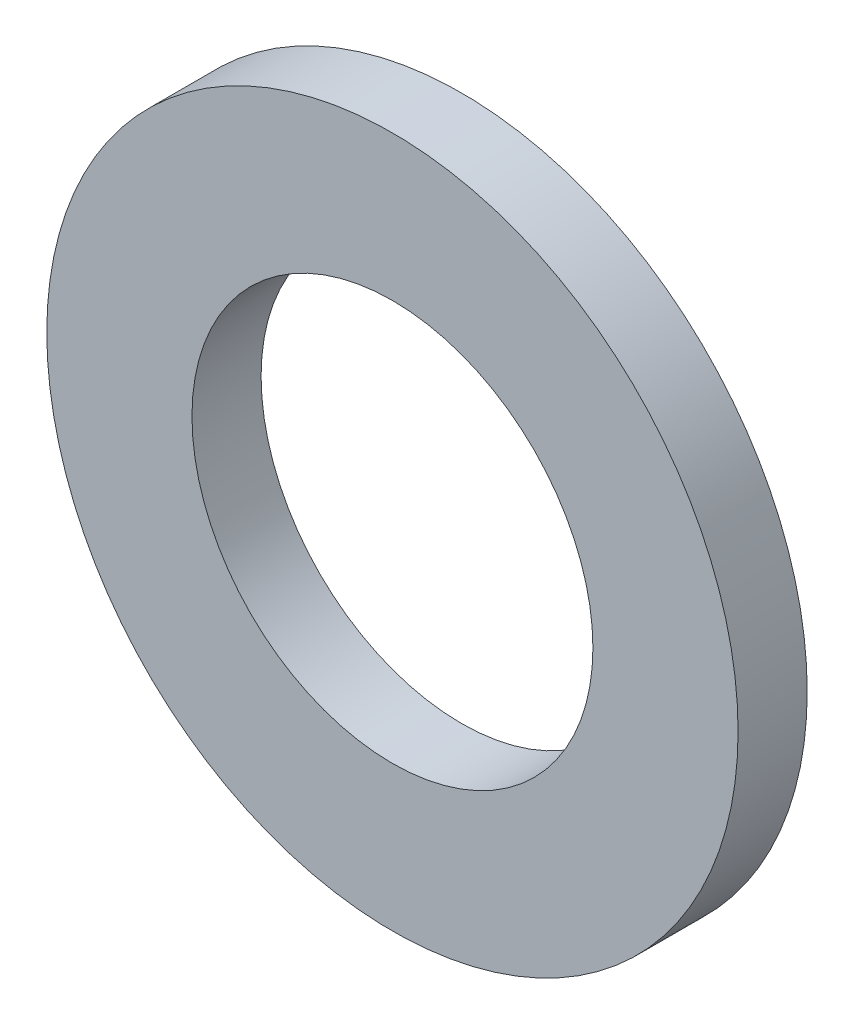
ISO-10303-21;
HEADER;
FILE_DESCRIPTION(('STEP AP214'),'2;1');
FILE_NAME('part.step','',(''),(''),'','','');
FILE_SCHEMA(('AUTOMOTIVE_DESIGN { 1 0 10303 214 1 1 1 1 }'));
ENDSEC;
DATA;
#1=APPLICATION_CONTEXT('core data for automotive mechanical design processes');
#2=APPLICATION_PROTOCOL_DEFINITION('international standard','automotive_design',2000,#1);
#3=PRODUCT_CONTEXT('',#1,'mechanical');
#4=PRODUCT('Part','Part','',(#3));
#5=PRODUCT_RELATED_PRODUCT_CATEGORY('part','',(#4));
#6=PRODUCT_DEFINITION_FORMATION('','',#4);
#7=PRODUCT_DEFINITION_CONTEXT('part definition',#1,'design');
#8=PRODUCT_DEFINITION('design','',#6,#7);
#9=PRODUCT_DEFINITION_SHAPE('','',#8);
#10=(LENGTH_UNIT() NAMED_UNIT(*) SI_UNIT(.MILLI.,.METRE.));
#11=(NAMED_UNIT(*) PLANE_ANGLE_UNIT() SI_UNIT($,.RADIAN.));
#12=(NAMED_UNIT(*) SI_UNIT($,.STERADIAN.) SOLID_ANGLE_UNIT());
#13=UNCERTAINTY_MEASURE_WITH_UNIT(LENGTH_MEASURE(1.E-05),#10,'distance_accuracy_value','');
#14=(GEOMETRIC_REPRESENTATION_CONTEXT(3) GLOBAL_UNCERTAINTY_ASSIGNED_CONTEXT((#13)) GLOBAL_UNIT_ASSIGNED_CONTEXT((#10,
#11,#12)) REPRESENTATION_CONTEXT('',''));
#15=CARTESIAN_POINT('',(0.,0.,0.));
#16=DIRECTION('',(0.,0.,1.));
#17=DIRECTION('',(1.,0.,0.));
#18=AXIS2_PLACEMENT_3D('',#15,#16,#17);
#19=CARTESIAN_POINT('',(0.,0.,2.5));
#20=DIRECTION('',(0.,0.,1.));
#21=DIRECTION('',(1.,0.,0.));
#22=AXIS2_PLACEMENT_3D('',#19,#20,#21);
#23=PLANE('',#22);
#24=CARTESIAN_POINT('',(0.,0.,2.5));
#25=DIRECTION('',(0.,0.,1.));
#26=DIRECTION('',(1.,0.,0.));
#27=AXIS2_PLACEMENT_3D('',#24,#25,#26);
#28=CIRCLE('',#27,12.5);
#29=CARTESIAN_POINT('',(12.5,0.,2.5));
#30=VERTEX_POINT('',#29);
#31=EDGE_CURVE('E10',#30,#30,#28,.T.);
#32=ORIENTED_EDGE('',*,*,#31,.T.);
#33=EDGE_LOOP('',(#32));
#34=FACE_BOUND('',#33,.T.);
#35=CARTESIAN_POINT('',(0.,0.,2.5));
#36=DIRECTION('',(0.,0.,1.));
#37=DIRECTION('',(1.,0.,0.));
#38=AXIS2_PLACEMENT_3D('',#35,#36,#37);
#39=CIRCLE('',#38,7.25);
#40=CARTESIAN_POINT('',(7.25,0.,2.5));
#41=VERTEX_POINT('',#40);
#42=EDGE_CURVE('E43',#41,#41,#39,.T.);
#43=ORIENTED_EDGE('',*,*,#42,.F.);
#44=EDGE_LOOP('',(#43));
#45=FACE_BOUND('',#44,.T.);
#46=ADVANCED_FACE('F32',(#34,#45),#23,.T.);
#47=CARTESIAN_POINT('',(0.,0.,0.));
#48=DIRECTION('',(0.,0.,1.));
#49=DIRECTION('',(1.,0.,0.));
#50=AXIS2_PLACEMENT_3D('',#47,#48,#49);
#51=PLANE('',#50);
#52=CARTESIAN_POINT('',(0.,0.,0.));
#53=DIRECTION('',(0.,0.,1.));
#54=DIRECTION('',(1.,0.,0.));
#55=AXIS2_PLACEMENT_3D('',#52,#53,#54);
#56=CIRCLE('',#55,12.5);
#57=CARTESIAN_POINT('',(12.5,0.,0.));
#58=VERTEX_POINT('',#57);
#59=EDGE_CURVE('E36',#58,#58,#56,.T.);
#60=ORIENTED_EDGE('',*,*,#59,.F.);
#61=EDGE_LOOP('',(#60));
#62=FACE_BOUND('',#61,.T.);
#63=CARTESIAN_POINT('',(0.,0.,0.));
#64=DIRECTION('',(0.,0.,1.));
#65=DIRECTION('',(1.,0.,0.));
#66=AXIS2_PLACEMENT_3D('',#63,#64,#65);
#67=CIRCLE('',#66,7.25);
#68=CARTESIAN_POINT('',(7.25,0.,0.));
#69=VERTEX_POINT('',#68);
#70=EDGE_CURVE('E45',#69,#69,#67,.T.);
#71=ORIENTED_EDGE('',*,*,#70,.T.);
#72=EDGE_LOOP('',(#71));
#73=FACE_BOUND('',#72,.T.);
#74=ADVANCED_FACE('F55',(#62,#73),#51,.F.);
#75=CARTESIAN_POINT('',(0.,0.,2.5));
#76=DIRECTION('',(0.,0.,-1.));
#77=DIRECTION('',(-1.,0.,0.));
#78=AXIS2_PLACEMENT_3D('',#75,#76,#77);
#79=CYLINDRICAL_SURFACE('',#78,12.5);
#80=ORIENTED_EDGE('',*,*,#31,.F.);
#81=EDGE_LOOP('',(#80));
#82=FACE_BOUND('',#81,.T.);
#83=ORIENTED_EDGE('',*,*,#59,.T.);
#84=EDGE_LOOP('',(#83));
#85=FACE_BOUND('',#84,.T.);
#86=ADVANCED_FACE('F34',(#82,#85),#79,.T.);
#87=CARTESIAN_POINT('',(0.,0.,2.5));
#88=DIRECTION('',(0.,0.,-1.));
#89=DIRECTION('',(-1.,0.,0.));
#90=AXIS2_PLACEMENT_3D('',#87,#88,#89);
#91=CYLINDRICAL_SURFACE('',#90,7.25);
#92=ORIENTED_EDGE('',*,*,#42,.T.);
#93=EDGE_LOOP('',(#92));
#94=FACE_BOUND('',#93,.T.);
#95=ORIENTED_EDGE('',*,*,#70,.F.);
#96=EDGE_LOOP('',(#95));
#97=FACE_BOUND('',#96,.T.);
#98=ADVANCED_FACE('F51',(#94,#97),#91,.F.);
#99=CLOSED_SHELL('',(#46,#74,#86,#98));
#100=MANIFOLD_SOLID_BREP('B2',#99);
#101=ADVANCED_BREP_SHAPE_REPRESENTATION('',(#18,#100),#14);
#102=SHAPE_DEFINITION_REPRESENTATION(#9,#101);
ENDSEC;
END-ISO-10303-21;
